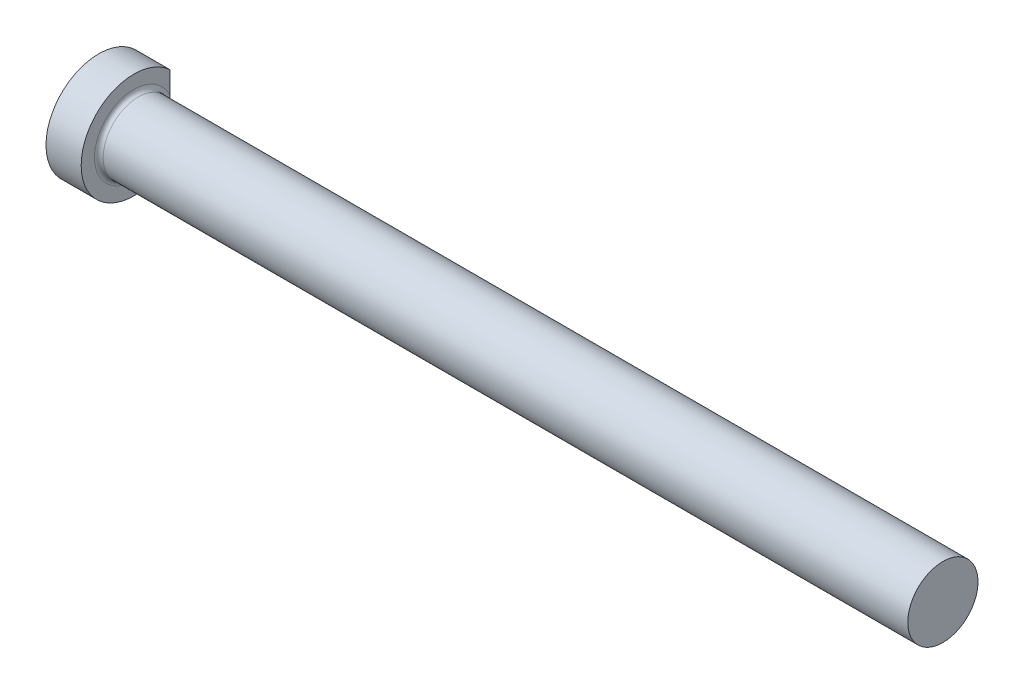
ISO-10303-21;
HEADER;
FILE_DESCRIPTION(('STEP AP214'),'2;1');
FILE_NAME('part.step','',(''),(''),'','','');
FILE_SCHEMA(('AUTOMOTIVE_DESIGN { 1 0 10303 214 1 1 1 1 }'));
ENDSEC;
DATA;
#1=APPLICATION_CONTEXT('core data for automotive mechanical design processes');
#2=APPLICATION_PROTOCOL_DEFINITION('international standard','automotive_design',2000,#1);
#3=PRODUCT_CONTEXT('',#1,'mechanical');
#4=PRODUCT('Part','Part','',(#3));
#5=PRODUCT_RELATED_PRODUCT_CATEGORY('part','',(#4));
#6=PRODUCT_DEFINITION_FORMATION('','',#4);
#7=PRODUCT_DEFINITION_CONTEXT('part definition',#1,'design');
#8=PRODUCT_DEFINITION('design','',#6,#7);
#9=PRODUCT_DEFINITION_SHAPE('','',#8);
#10=(LENGTH_UNIT() NAMED_UNIT(*) SI_UNIT(.MILLI.,.METRE.));
#11=(NAMED_UNIT(*) PLANE_ANGLE_UNIT() SI_UNIT($,.RADIAN.));
#12=(NAMED_UNIT(*) SI_UNIT($,.STERADIAN.) SOLID_ANGLE_UNIT());
#13=UNCERTAINTY_MEASURE_WITH_UNIT(LENGTH_MEASURE(1.E-05),#10,'distance_accuracy_value','');
#14=(GEOMETRIC_REPRESENTATION_CONTEXT(3) GLOBAL_UNCERTAINTY_ASSIGNED_CONTEXT((#13)) GLOBAL_UNIT_ASSIGNED_CONTEXT((#10,
#11,#12)) REPRESENTATION_CONTEXT('',''));
#15=CARTESIAN_POINT('',(0.,0.,0.));
#16=DIRECTION('',(0.,0.,1.));
#17=DIRECTION('',(1.,0.,0.));
#18=AXIS2_PLACEMENT_3D('',#15,#16,#17);
#19=CARTESIAN_POINT('',(0.,0.,0.));
#20=DIRECTION('',(1.,0.,0.));
#21=DIRECTION('',(0.,1.,0.));
#22=AXIS2_PLACEMENT_3D('',#19,#20,#21);
#23=PLANE('',#22);
#24=DIRECTION('',(0.,1.,0.));
#25=VECTOR('',#24,1.);
#26=CARTESIAN_POINT('',(0.,0.,-6.52145000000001));
#27=LINE('',#26,#25);
#28=CARTESIAN_POINT('',(0.,-6.94235658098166,-6.52145000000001));
#29=VERTEX_POINT('',#28);
#30=CARTESIAN_POINT('',(0.,6.94235658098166,-6.52145));
#31=VERTEX_POINT('',#30);
#32=EDGE_CURVE('E49',#29,#31,#27,.T.);
#33=ORIENTED_EDGE('',*,*,#32,.F.);
#34=CARTESIAN_POINT('',(0.,0.,0.));
#35=DIRECTION('',(-1.,0.,0.));
#36=DIRECTION('',(0.,-1.,0.));
#37=AXIS2_PLACEMENT_3D('',#34,#35,#36);
#38=CIRCLE('',#37,9.52499999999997);
#39=EDGE_CURVE('E43',#29,#31,#38,.T.);
#40=ORIENTED_EDGE('',*,*,#39,.T.);
#41=EDGE_LOOP('',(#33,#40));
#42=FACE_BOUND('',#41,.T.);
#43=ADVANCED_FACE('F32',(#42),#23,.F.);
#44=CARTESIAN_POINT('',(152.4,0.,0.));
#45=DIRECTION('',(-1.,0.,0.));
#46=DIRECTION('',(0.,-1.,0.));
#47=AXIS2_PLACEMENT_3D('',#44,#45,#46);
#48=CYLINDRICAL_SURFACE('',#47,9.52499999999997);
#49=DIRECTION('',(-1.,0.,0.));
#50=VECTOR('',#49,1.);
#51=CARTESIAN_POINT('',(152.4,-6.94235658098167,-6.52145000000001));
#52=LINE('',#51,#50);
#53=CARTESIAN_POINT('',(6.34999999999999,-6.94235658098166,-6.52145000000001));
#54=VERTEX_POINT('',#53);
#55=EDGE_CURVE('E87',#54,#29,#52,.T.);
#56=ORIENTED_EDGE('',*,*,#55,.F.);
#57=CARTESIAN_POINT('',(6.34999999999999,0.,0.));
#58=DIRECTION('',(-1.,0.,0.));
#59=DIRECTION('',(0.,-1.,0.));
#60=AXIS2_PLACEMENT_3D('',#57,#58,#59);
#61=CIRCLE('',#60,9.52499999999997);
#62=CARTESIAN_POINT('',(6.35,6.94235658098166,-6.52145000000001));
#63=VERTEX_POINT('',#62);
#64=EDGE_CURVE('E75',#54,#63,#61,.T.);
#65=ORIENTED_EDGE('',*,*,#64,.T.);
#66=DIRECTION('',(-1.,0.,0.));
#67=VECTOR('',#66,1.);
#68=CARTESIAN_POINT('',(152.4,6.94235658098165,-6.52145000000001));
#69=LINE('',#68,#67);
#70=EDGE_CURVE('E56',#31,#63,#69,.F.);
#71=ORIENTED_EDGE('',*,*,#70,.F.);
#72=ORIENTED_EDGE('',*,*,#39,.F.);
#73=EDGE_LOOP('',(#56,#65,#71,#72));
#74=FACE_BOUND('',#73,.T.);
#75=ADVANCED_FACE('F97',(#74),#48,.T.);
#76=CARTESIAN_POINT('',(6.35,9.52499999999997,0.));
#77=DIRECTION('',(-1.,0.,0.));
#78=DIRECTION('',(0.,-1.,0.));
#79=AXIS2_PLACEMENT_3D('',#76,#77,#78);
#80=PLANE('',#79);
#81=DIRECTION('',(0.,-1.,0.));
#82=VECTOR('',#81,1.);
#83=CARTESIAN_POINT('',(6.35,9.52499999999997,-6.52145));
#84=LINE('',#83,#82);
#85=CARTESIAN_POINT('',(6.34999999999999,2.88488543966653,-6.52145000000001));
#86=VERTEX_POINT('',#85);
#87=EDGE_CURVE('E84',#63,#86,#84,.T.);
#88=ORIENTED_EDGE('',*,*,#87,.F.);
#89=ORIENTED_EDGE('',*,*,#64,.F.);
#90=CARTESIAN_POINT('',(6.35,-2.88488543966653,-6.52145000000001));
#91=VERTEX_POINT('',#90);
#92=EDGE_CURVE('E80',#91,#54,#84,.T.);
#93=ORIENTED_EDGE('',*,*,#92,.F.);
#94=CARTESIAN_POINT('',(6.34999999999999,0.,0.));
#95=DIRECTION('',(-1.,0.,0.));
#96=DIRECTION('',(0.,-1.,0.));
#97=AXIS2_PLACEMENT_3D('',#94,#95,#96);
#98=CIRCLE('',#97,7.13105);
#99=EDGE_CURVE('E70',#91,#86,#98,.T.);
#100=ORIENTED_EDGE('',*,*,#99,.T.);
#101=EDGE_LOOP('',(#88,#89,#93,#100));
#102=FACE_BOUND('',#101,.T.);
#103=ADVANCED_FACE('F81',(#102),#80,.F.);
#104=CARTESIAN_POINT('',(7.1374,0.,0.));
#105=DIRECTION('',(-1.,0.,0.));
#106=DIRECTION('',(0.,-1.,0.));
#107=AXIS2_PLACEMENT_3D('',#104,#105,#106);
#108=TOROIDAL_SURFACE('',#107,7.13105,0.7874);
#109=CARTESIAN_POINT('',(7.13739999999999,0.,0.));
#110=DIRECTION('',(-1.,0.,0.));
#111=DIRECTION('',(0.,-1.,0.));
#112=AXIS2_PLACEMENT_3D('',#109,#110,#111);
#113=CIRCLE('',#112,6.34365);
#114=CARTESIAN_POINT('',(7.13739999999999,-6.34365,0.));
#115=VERTEX_POINT('',#114);
#116=EDGE_CURVE('E76',#115,#115,#113,.T.);
#117=ORIENTED_EDGE('',*,*,#116,.T.);
#118=EDGE_LOOP('',(#117));
#119=FACE_BOUND('',#118,.T.);
#120=CARTESIAN_POINT('',(6.63901601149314,0.,-6.52145000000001));
#121=CARTESIAN_POINT('',(6.63902084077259,-0.0657534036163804,-6.52145000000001));
#122=CARTESIAN_POINT('',(6.63779183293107,-0.131503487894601,-6.52145000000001));
#123=CARTESIAN_POINT('',(6.63299144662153,-0.262919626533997,-6.52145000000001));
#124=CARTESIAN_POINT('',(6.62941998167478,-0.328585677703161,-6.52145000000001));
#125=CARTESIAN_POINT('',(6.61555667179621,-0.525538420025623,-6.52145000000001));
#126=CARTESIAN_POINT('',(6.60211709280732,-0.656599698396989,-6.52145000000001));
#127=CARTESIAN_POINT('',(6.57006436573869,-0.918990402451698,-6.52145000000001));
#128=CARTESIAN_POINT('',(6.55141446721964,-1.05031490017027,-6.52145000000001));
#129=CARTESIAN_POINT('',(6.51252249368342,-1.31265734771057,-6.52145000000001));
#130=CARTESIAN_POINT('',(6.49228114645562,-1.44367540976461,-6.52145000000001));
#131=CARTESIAN_POINT('',(6.45655018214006,-1.68331592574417,-6.52145000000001));
#132=CARTESIAN_POINT('',(6.4408430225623,-1.79190481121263,-6.52145000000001));
#133=CARTESIAN_POINT('',(6.41188413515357,-2.00944367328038,-6.52145000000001));
#134=CARTESIAN_POINT('',(6.39863294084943,-2.11839372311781,-6.52145000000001));
#135=CARTESIAN_POINT('',(6.3761136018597,-2.33641072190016,-6.52145000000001));
#136=CARTESIAN_POINT('',(6.36683411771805,-2.44547643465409,-6.52145000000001));
#137=CARTESIAN_POINT('',(6.35380717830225,-2.6639050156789,-6.52145000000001));
#138=CARTESIAN_POINT('',(6.3500574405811,-2.77326774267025,-6.52145000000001));
#139=CARTESIAN_POINT('',(6.34993436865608,-3.00977523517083,-6.52145000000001));
#140=CARTESIAN_POINT('',(6.35485029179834,-3.13693903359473,-6.52145000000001));
#141=CARTESIAN_POINT('',(6.37264607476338,-3.32671806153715,-6.52145000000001));
#142=CARTESIAN_POINT('',(6.38031590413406,-3.38982109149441,-6.52145000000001));
#143=CARTESIAN_POINT('',(6.39980489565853,-3.51537189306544,-6.52145000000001));
#144=CARTESIAN_POINT('',(6.41162214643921,-3.57781995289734,-6.52145000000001));
#145=CARTESIAN_POINT('',(6.44286462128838,-3.71305001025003,-6.52145000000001));
#146=CARTESIAN_POINT('',(6.46329264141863,-3.78560742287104,-6.52145000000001));
#147=CARTESIAN_POINT('',(6.51291774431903,-3.92772137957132,-6.52145000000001));
#148=CARTESIAN_POINT('',(6.54210352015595,-3.99728166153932,-6.52145000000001));
#149=CARTESIAN_POINT('',(6.59978512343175,-4.10780384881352,-6.52145000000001));
#150=CARTESIAN_POINT('',(6.62510267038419,-4.15040980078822,-6.52145000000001));
#151=CARTESIAN_POINT('',(6.68147530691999,-4.23168965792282,-6.52145000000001));
#152=CARTESIAN_POINT('',(6.71252131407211,-4.27036963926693,-6.52145000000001));
#153=CARTESIAN_POINT('',(6.77068727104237,-4.33067091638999,-6.52145000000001));
#154=CARTESIAN_POINT('',(6.79612730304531,-4.35390154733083,-6.52145000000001));
#155=CARTESIAN_POINT('',(6.85028357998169,-4.39619481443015,-6.52145000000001));
#156=CARTESIAN_POINT('',(6.8789948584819,-4.41526364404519,-6.52145000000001));
#157=CARTESIAN_POINT('',(6.93336704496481,-4.4445543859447,-6.52145000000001));
#158=CARTESIAN_POINT('',(6.95848084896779,-4.45578416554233,-6.52145000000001));
#159=CARTESIAN_POINT('',(7.01022987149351,-4.47393010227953,-6.52145000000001));
#160=CARTESIAN_POINT('',(7.03686384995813,-4.48084972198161,-6.52145000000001));
#161=CARTESIAN_POINT('',(7.09110348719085,-4.48982024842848,-6.52145000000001));
#162=CARTESIAN_POINT('',(7.11871361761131,-4.49184465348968,-6.52145000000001));
#163=CARTESIAN_POINT('',(7.17383099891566,-4.49074932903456,-6.52145000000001));
#164=CARTESIAN_POINT('',(7.20133825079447,-4.48762964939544,-6.52145000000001));
#165=CARTESIAN_POINT('',(7.25311853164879,-4.47700440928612,-6.52145000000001));
#166=CARTESIAN_POINT('',(7.27747183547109,-4.46987936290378,-6.52145000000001));
#167=CARTESIAN_POINT('',(7.32481845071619,-4.45205278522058,-6.52145000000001));
#168=CARTESIAN_POINT('',(7.34781125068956,-4.44134991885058,-6.52145000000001));
#169=CARTESIAN_POINT('',(7.40199922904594,-4.4115301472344,-6.52145000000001));
#170=CARTESIAN_POINT('',(7.43229885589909,-4.39078774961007,-6.52145000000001));
#171=CARTESIAN_POINT('',(7.4892053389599,-4.34474460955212,-6.52145000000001));
#172=CARTESIAN_POINT('',(7.51580328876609,-4.31943319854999,-6.52145000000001));
#173=CARTESIAN_POINT('',(7.57915674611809,-4.25073674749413,-6.52145000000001));
#174=CARTESIAN_POINT('',(7.61343063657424,-4.20507938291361,-6.52145000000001));
#175=CARTESIAN_POINT('',(7.67475541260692,-4.1091864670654,-6.52145000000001));
#176=CARTESIAN_POINT('',(7.7017889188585,-4.05894028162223,-6.52145000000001));
#177=CARTESIAN_POINT('',(7.74757639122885,-3.96057339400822,-6.52145000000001));
#178=CARTESIAN_POINT('',(7.76687064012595,-3.91269888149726,-6.52145000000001));
#179=CARTESIAN_POINT('',(7.80130493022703,-3.8154573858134,-6.52145000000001));
#180=CARTESIAN_POINT('',(7.81644142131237,-3.76608916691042,-6.52145000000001));
#181=CARTESIAN_POINT('',(7.84317436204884,-3.66637393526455,-6.52145000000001));
#182=CARTESIAN_POINT('',(7.85476779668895,-3.61602612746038,-6.52145000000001));
#183=CARTESIAN_POINT('',(7.87489546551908,-3.51475319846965,-6.52145000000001));
#184=CARTESIAN_POINT('',(7.88343080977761,-3.46382829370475,-6.52145000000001));
#185=CARTESIAN_POINT('',(7.90081343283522,-3.34073199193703,-6.52145000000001));
#186=CARTESIAN_POINT('',(7.90836415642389,-3.26837834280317,-6.52145000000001));
#187=CARTESIAN_POINT('',(7.9191614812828,-3.12333962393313,-6.52145000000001));
#188=CARTESIAN_POINT('',(7.92240596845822,-3.05065440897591,-6.52145000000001));
#189=CARTESIAN_POINT('',(7.92681879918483,-2.83226208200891,-6.52145000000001));
#190=CARTESIAN_POINT('',(7.92263904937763,-2.68645072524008,-6.52145000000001));
#191=CARTESIAN_POINT('',(7.9045807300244,-2.39430758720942,-6.52145000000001));
#192=CARTESIAN_POINT('',(7.89061938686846,-2.24798204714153,-6.52145000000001));
#193=CARTESIAN_POINT('',(7.85666945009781,-1.95619536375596,-6.52145000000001));
#194=CARTESIAN_POINT('',(7.83668605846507,-1.81073358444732,-6.52145000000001));
#195=CARTESIAN_POINT('',(7.791757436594,-1.50326298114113,-6.52145000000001));
#196=CARTESIAN_POINT('',(7.76650533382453,-1.34130284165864,-6.52145000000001));
#197=CARTESIAN_POINT('',(7.7184534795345,-1.0169174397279,-6.52145000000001));
#198=CARTESIAN_POINT('',(7.69565444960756,-0.854492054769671,-6.52145000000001));
#199=CARTESIAN_POINT('',(7.66840605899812,-0.610912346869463,-6.52145000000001));
#200=CARTESIAN_POINT('',(7.66050579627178,-0.530162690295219,-6.52145000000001));
#201=CARTESIAN_POINT('',(7.64772548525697,-0.368430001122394,-6.52145000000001));
#202=CARTESIAN_POINT('',(7.64284496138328,-0.28744700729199,-6.52145000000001));
#203=CARTESIAN_POINT('',(7.63666088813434,-0.125423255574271,-6.52145000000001));
#204=CARTESIAN_POINT('',(7.63535361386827,-0.0443826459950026,-6.52145000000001));
#205=CARTESIAN_POINT('',(7.63646617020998,0.117672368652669,-6.52145000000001));
#206=CARTESIAN_POINT('',(7.63888603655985,0.198686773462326,-6.52145000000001));
#207=CARTESIAN_POINT('',(7.64754842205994,0.368097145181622,-6.52145000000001));
#208=CARTESIAN_POINT('',(7.65412707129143,0.456475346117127,-6.52145000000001));
#209=CARTESIAN_POINT('',(7.6705438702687,0.63293130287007,-6.52145000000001));
#210=CARTESIAN_POINT('',(7.68038260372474,0.721009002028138,-6.52145000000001));
#211=CARTESIAN_POINT('',(7.70227230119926,0.897034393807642,-6.52145000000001));
#212=CARTESIAN_POINT('',(7.71432705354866,0.984981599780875,-6.52145000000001));
#213=CARTESIAN_POINT('',(7.73958254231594,1.16070501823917,-6.52145000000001));
#214=CARTESIAN_POINT('',(7.75278325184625,1.24848123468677,-6.52145000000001));
#215=CARTESIAN_POINT('',(7.79286244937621,1.51332569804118,-6.52145000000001));
#216=CARTESIAN_POINT('',(7.81998837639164,1.69035351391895,-6.52145000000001));
#217=CARTESIAN_POINT('',(7.86804027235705,2.04511830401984,-6.52145000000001));
#218=CARTESIAN_POINT('',(7.88897428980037,2.22285405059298,-6.52145000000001));
#219=CARTESIAN_POINT('',(7.91089315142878,2.49056980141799,-6.52145000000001));
#220=CARTESIAN_POINT('',(7.91662067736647,2.58014479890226,-6.52145000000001));
#221=CARTESIAN_POINT('',(7.92393498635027,2.75945422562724,-6.52145000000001));
#222=CARTESIAN_POINT('',(7.92552294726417,2.84918860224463,-6.52145000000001));
#223=CARTESIAN_POINT('',(7.92346531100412,3.02823664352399,-6.52145000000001));
#224=CARTESIAN_POINT('',(7.91984188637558,3.11755047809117,-6.52145000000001));
#225=CARTESIAN_POINT('',(7.90605287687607,3.29564078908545,-6.52145000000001));
#226=CARTESIAN_POINT('',(7.89589322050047,3.3844176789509,-6.52145000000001));
#227=CARTESIAN_POINT('',(7.87058314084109,3.54015032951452,-6.52145000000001));
#228=CARTESIAN_POINT('',(7.85714310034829,3.60737888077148,-6.52145000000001));
#229=CARTESIAN_POINT('',(7.82424330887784,3.74053570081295,-6.52145000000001));
#230=CARTESIAN_POINT('',(7.8047720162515,3.80646121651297,-6.52145000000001));
#231=CARTESIAN_POINT('',(7.75818358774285,3.93633611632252,-6.52145000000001));
#232=CARTESIAN_POINT('',(7.73099393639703,4.00026004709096,-6.52145000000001));
#233=CARTESIAN_POINT('',(7.66713633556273,4.12317261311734,-6.52145000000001));
#234=CARTESIAN_POINT('',(7.63050617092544,4.18217970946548,-6.52145000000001));
#235=CARTESIAN_POINT('',(7.56640055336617,4.2642733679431,-6.52145000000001));
#236=CARTESIAN_POINT('',(7.54328352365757,4.29075288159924,-6.52145000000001));
#237=CARTESIAN_POINT('',(7.4936939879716,4.34045315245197,-6.52145000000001));
#238=CARTESIAN_POINT('',(7.46721989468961,4.36367235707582,-6.52145000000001));
#239=CARTESIAN_POINT('',(7.41045887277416,4.40585844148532,-6.52145000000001));
#240=CARTESIAN_POINT('',(7.38012589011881,4.42476461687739,-6.52145000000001));
#241=CARTESIAN_POINT('',(7.31633520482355,4.45623759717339,-6.52145000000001));
#242=CARTESIAN_POINT('',(7.28288680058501,4.4688225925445,-6.52145000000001));
#243=CARTESIAN_POINT('',(7.22374489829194,4.48371675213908,-6.52145000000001));
#244=CARTESIAN_POINT('',(7.19852449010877,4.48792289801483,-6.52145000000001));
#245=CARTESIAN_POINT('',(7.1477347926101,4.49198717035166,-6.52145000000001));
#246=CARTESIAN_POINT('',(7.12216566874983,4.49184729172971,-6.52145000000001));
#247=CARTESIAN_POINT('',(7.07145636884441,4.48723121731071,-6.52145000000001));
#248=CARTESIAN_POINT('',(7.04631577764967,4.48275949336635,-6.52145000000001));
#249=CARTESIAN_POINT('',(6.99708305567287,4.46983941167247,-6.52145000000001));
#250=CARTESIAN_POINT('',(6.97299161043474,4.46138849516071,-6.52145000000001));
#251=CARTESIAN_POINT('',(6.91915923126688,4.43794195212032,-6.52145000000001));
#252=CARTESIAN_POINT('',(6.88994765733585,4.4217346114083,-6.52145000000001));
#253=CARTESIAN_POINT('',(6.83453526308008,4.38481426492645,-6.52145000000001));
#254=CARTESIAN_POINT('',(6.8083403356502,4.36409266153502,-6.52145000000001));
#255=CARTESIAN_POINT('',(6.74707941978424,4.30850965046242,-6.52145000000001));
#256=CARTESIAN_POINT('',(6.71383735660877,4.27165200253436,-6.52145000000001));
#257=CARTESIAN_POINT('',(6.65336478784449,4.19333281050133,-6.52145000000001));
#258=CARTESIAN_POINT('',(6.62614746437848,4.15186146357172,-6.52145000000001));
#259=CARTESIAN_POINT('',(6.58012418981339,4.07165818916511,-6.52145000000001));
#260=CARTESIAN_POINT('',(6.56068271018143,4.03328369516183,-6.52145000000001));
#261=CARTESIAN_POINT('',(6.52516812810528,3.95499304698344,-6.52145000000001));
#262=CARTESIAN_POINT('',(6.50909762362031,3.91507573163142,-6.52145000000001));
#263=CARTESIAN_POINT('',(6.46523070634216,3.79365163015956,-6.52145000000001));
#264=CARTESIAN_POINT('',(6.44182464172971,3.71055844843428,-6.52145000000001));
#265=CARTESIAN_POINT('',(6.40363508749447,3.54085873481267,-6.52145000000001));
#266=CARTESIAN_POINT('',(6.38902802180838,3.45421530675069,-6.52145000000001));
#267=CARTESIAN_POINT('',(6.36709312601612,3.27994363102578,-6.52145000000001));
#268=CARTESIAN_POINT('',(6.35977402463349,3.19231432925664,-6.52145000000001));
#269=CARTESIAN_POINT('',(6.35091901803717,3.01652032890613,-6.52145000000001));
#270=CARTESIAN_POINT('',(6.34940137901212,2.92835481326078,-6.52145000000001));
#271=CARTESIAN_POINT('',(6.35100728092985,2.75216125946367,-6.52145000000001));
#272=CARTESIAN_POINT('',(6.35412677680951,2.66413316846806,-6.52145000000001));
#273=CARTESIAN_POINT('',(6.36516154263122,2.46799719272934,-6.52145000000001));
#274=CARTESIAN_POINT('',(6.37401765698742,2.3599449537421,-6.52145000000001));
#275=CARTESIAN_POINT('',(6.39569756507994,2.14423278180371,-6.52145000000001));
#276=CARTESIAN_POINT('',(6.40852237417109,2.03657295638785,-6.52145000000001));
#277=CARTESIAN_POINT('',(6.43673095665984,1.82135167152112,-6.52145000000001));
#278=CARTESIAN_POINT('',(6.45212045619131,1.71379098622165,-6.52145000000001));
#279=CARTESIAN_POINT('',(6.48397283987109,1.49882741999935,-6.52145000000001));
#280=CARTESIAN_POINT('',(6.50043578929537,1.39142454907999,-6.52145000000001));
#281=CARTESIAN_POINT('',(6.53269454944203,1.17742782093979,-6.52145000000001));
#282=CARTESIAN_POINT('',(6.54849476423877,1.07083465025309,-6.52145000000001));
#283=CARTESIAN_POINT('',(6.57778587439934,0.857314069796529,-6.52145000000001));
#284=CARTESIAN_POINT('',(6.59127670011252,0.750386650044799,-6.52145000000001));
#285=CARTESIAN_POINT('',(6.61397296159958,0.536384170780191,-6.52145000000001));
#286=CARTESIAN_POINT('',(6.62319137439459,0.429310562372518,-6.52145000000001));
#287=CARTESIAN_POINT('',(6.63570807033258,0.214821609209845,-6.52145000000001));
#288=CARTESIAN_POINT('',(6.63900812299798,0.107406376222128,-6.52145000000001));
#289=CARTESIAN_POINT('',(6.63901601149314,0.,-6.52145000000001));
#290=B_SPLINE_CURVE_WITH_KNOTS('',3,(#120,#121,#122,#123,#124,#125,#126,#127,#128,#129,#130,
#131,#132,#133,#134,#135,#136,#137,#138,#139,#140,#141,#142,#143,#144,#145,#146,#147,#148,#149,
#150,#151,#152,#153,#154,#155,#156,#157,#158,#159,#160,#161,#162,#163,#164,#165,#166,#167,#168,
#169,#170,#171,#172,#173,#174,#175,#176,#177,#178,#179,#180,#181,#182,#183,#184,#185,#186,#187,
#188,#189,#190,#191,#192,#193,#194,#195,#196,#197,#198,#199,#200,#201,#202,#203,#204,#205,#206,
#207,#208,#209,#210,#211,#212,#213,#214,#215,#216,#217,#218,#219,#220,#221,#222,#223,#224,#225,
#226,#227,#228,#229,#230,#231,#232,#233,#234,#235,#236,#237,#238,#239,#240,#241,#242,#243,#244,
#245,#246,#247,#248,#249,#250,#251,#252,#253,#254,#255,#256,#257,#258,#259,#260,#261,#262,#263,
#264,#265,#266,#267,#268,#269,#270,#271,#272,#273,#274,#275,#276,#277,#278,#279,#280,#281,#282,
#283,#284,#285,#286,#287,#288,#289),.UNSPECIFIED.,.T.,.F.,(4,2,2,2,2,2,2,2,2,2,2,2,2,2,2,2,2,2,
2,2,2,2,2,2,2,2,2,2,2,2,2,2,2,2,2,2,2,2,2,2,2,2,2,2,2,2,2,2,2,2,2,2,2,2,2,2,2,2,2,2,2,2,2,2,2,2,
2,2,2,2,2,2,2,2,2,2,2,2,2,2,2,2,2,2,4),(0.,0.197243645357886,0.394494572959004,
0.789535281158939,1.18743594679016,1.58515569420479,1.91430010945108,2.24351594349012,
2.57178547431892,2.89991947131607,3.28105347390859,3.47164766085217,3.66215412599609,
3.88789053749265,4.11333675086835,4.26167383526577,4.40977772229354,4.51281553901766,
4.61569895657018,4.69789960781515,4.78003413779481,4.86261234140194,4.94518974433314,
5.02099756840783,5.0968337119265,5.20637025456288,5.3161659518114,5.48647780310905,
5.65719486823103,5.81181774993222,5.96657224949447,6.12145807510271,6.27628762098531,
6.49435732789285,6.71253405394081,7.14958620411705,7.59038215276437,8.03079841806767,
8.5225782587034,9.01450236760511,9.25786214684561,9.50118358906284,9.74425128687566,
9.98732131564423,10.253108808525,10.5189439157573,10.7852377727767,11.0515253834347,
11.588819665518,12.1254124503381,12.3946126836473,12.6637363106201,12.9317182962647,
13.199457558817,13.4049243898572,13.6107868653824,13.8186513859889,14.0256965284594,
14.1309085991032,14.2361706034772,14.342833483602,14.4491876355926,14.5255497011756,
14.6018767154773,14.6781250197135,14.7544224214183,14.8540859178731,14.953940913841,
15.1020116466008,15.2504032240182,15.3792716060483,15.5082389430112,15.7664621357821,
16.0297039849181,16.2932607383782,16.5576466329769,16.8218020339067,17.1469363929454,
17.4721540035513,17.7981076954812,18.1240812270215,18.4473483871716,18.7706252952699,
19.0929137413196,19.4151058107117),.UNSPECIFIED.);
#291=EDGE_CURVE('E12',#86,#91,#290,.T.);
#292=ORIENTED_EDGE('',*,*,#291,.F.);
#293=ORIENTED_EDGE('',*,*,#99,.F.);
#294=EDGE_LOOP('',(#292,#293));
#295=FACE_BOUND('',#294,.T.);
#296=ADVANCED_FACE('F72',(#119,#295),#108,.F.);
#297=CARTESIAN_POINT('',(152.4,0.,0.));
#298=DIRECTION('',(-1.,0.,0.));
#299=DIRECTION('',(0.,-1.,0.));
#300=AXIS2_PLACEMENT_3D('',#297,#298,#299);
#301=CYLINDRICAL_SURFACE('',#300,6.34365000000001);
#302=ORIENTED_EDGE('',*,*,#116,.F.);
#303=EDGE_LOOP('',(#302));
#304=FACE_BOUND('',#303,.T.);
#305=CARTESIAN_POINT('',(152.4,0.,0.));
#306=DIRECTION('',(-1.,0.,0.));
#307=DIRECTION('',(0.,-1.,0.));
#308=AXIS2_PLACEMENT_3D('',#305,#306,#307);
#309=CIRCLE('',#308,6.34365000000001);
#310=CARTESIAN_POINT('',(152.4,-6.34365000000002,0.));
#311=VERTEX_POINT('',#310);
#312=EDGE_CURVE('E92',#311,#311,#309,.T.);
#313=ORIENTED_EDGE('',*,*,#312,.T.);
#314=EDGE_LOOP('',(#313));
#315=FACE_BOUND('',#314,.T.);
#316=ADVANCED_FACE('F107',(#304,#315),#301,.T.);
#317=CARTESIAN_POINT('',(152.4,6.34365,0.));
#318=DIRECTION('',(-1.,0.,0.));
#319=DIRECTION('',(0.,-1.,0.));
#320=AXIS2_PLACEMENT_3D('',#317,#318,#319);
#321=PLANE('',#320);
#322=ORIENTED_EDGE('',*,*,#312,.F.);
#323=EDGE_LOOP('',(#322));
#324=FACE_BOUND('',#323,.T.);
#325=ADVANCED_FACE('F111',(#324),#321,.F.);
#326=CARTESIAN_POINT('',(0.,0.,-6.52145000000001));
#327=DIRECTION('',(0.,0.,-1.));
#328=DIRECTION('',(0.,1.,0.));
#329=AXIS2_PLACEMENT_3D('',#326,#327,#328);
#330=PLANE('',#329);
#331=ORIENTED_EDGE('',*,*,#55,.T.);
#332=ORIENTED_EDGE('',*,*,#32,.T.);
#333=ORIENTED_EDGE('',*,*,#70,.T.);
#334=ORIENTED_EDGE('',*,*,#87,.T.);
#335=ORIENTED_EDGE('',*,*,#291,.T.);
#336=ORIENTED_EDGE('',*,*,#92,.T.);
#337=EDGE_LOOP('',(#331,#332,#333,#334,#335,#336));
#338=FACE_BOUND('',#337,.T.);
#339=ADVANCED_FACE('F86',(#338),#330,.T.);
#340=CLOSED_SHELL('',(#43,#75,#103,#296,#316,#325,#339));
#341=MANIFOLD_SOLID_BREP('B2',#340);
#342=ADVANCED_BREP_SHAPE_REPRESENTATION('',(#18,#341),#14);
#343=SHAPE_DEFINITION_REPRESENTATION(#9,#342);
ENDSEC;
END-ISO-10303-21;
